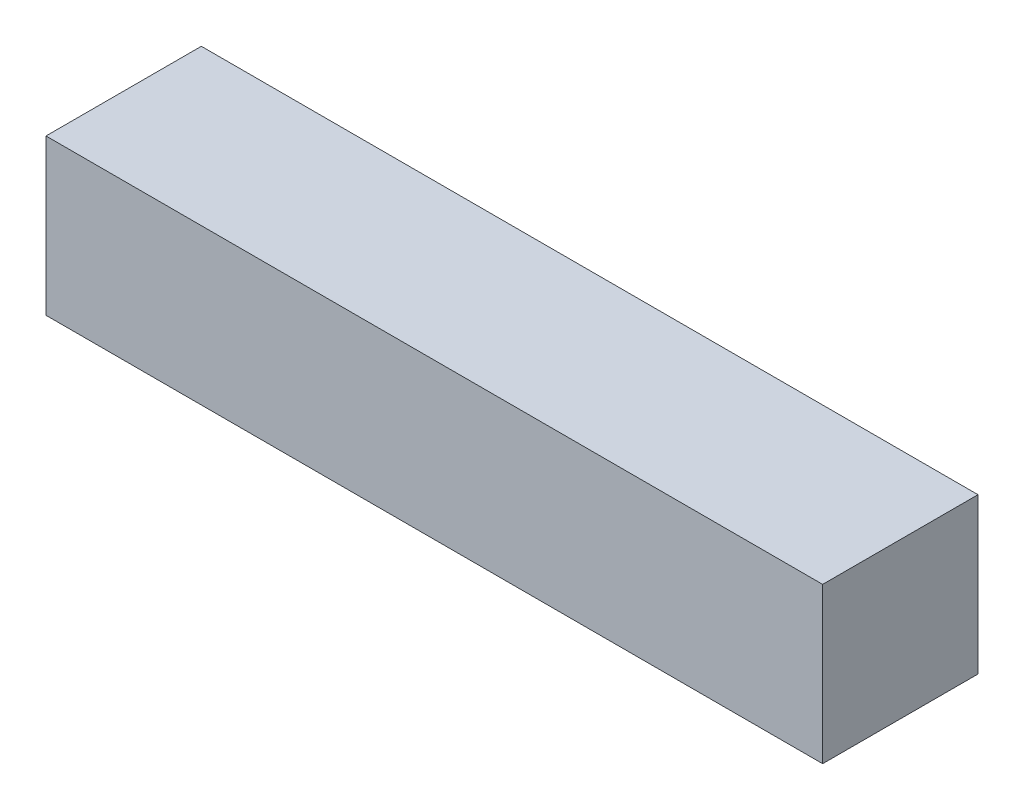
from build123d import *

# Parameters (mm, degrees)
SKETCH_1_W      = 400
SKETCH_1_H      = 80
EXTRUDE_1_DEPTH = 80


with BuildPart() as part:
    # Sketch 1 → Extrude 1 (new body)
    with BuildSketch(Plane.XY):
        Rectangle(SKETCH_1_W, SKETCH_1_H)
    extrude(amount=EXTRUDE_1_DEPTH)


solid = part.part
